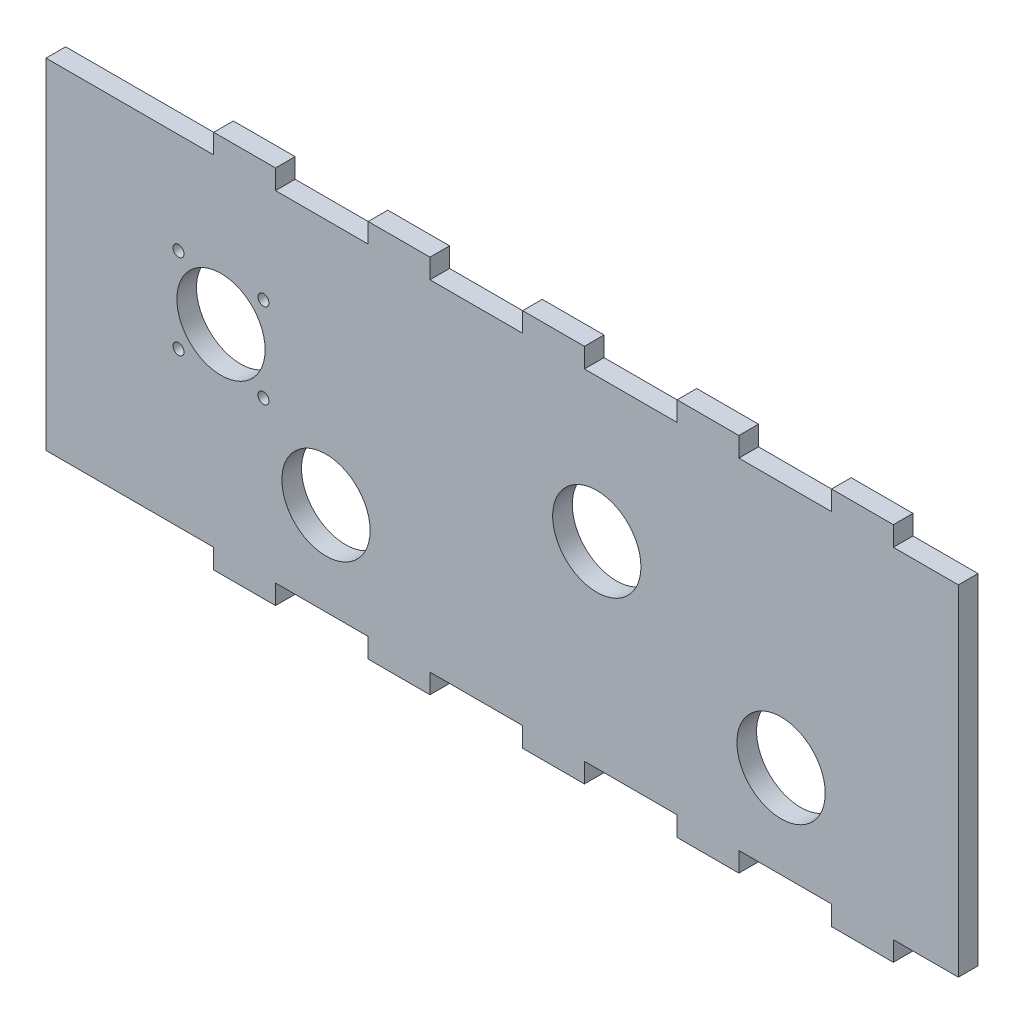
from build123d import *

# Parameters (mm, degrees)
SKETCH1_R           = 14.2875
SKETCH1_R_2         = 1.778
BOSS_EXTRUDE1_DEPTH = 6.35


with BuildPart() as part:
    # Sketch1 → Boss-Extrude1 (new body)
    with BuildSketch(Plane.XY):
        Polygon((0, 0), (54.3, 0), (54.3, -6.35), (74.3, -6.35), (74.3, 0), (104.3, 0), (104.3, -6.35), (124.3, -6.35), (124.3, 0), (154.3, 0), (154.3, -6.35), (174.3, -6.35), (174.3, 0), (204.3, 0), (204.3, -6.35), (224.3, -6.35), (224.3, 0), (254.3, 0), (254.3, -6.35), (274.3, -6.35), (274.3, 0), (295.36, 0), (295.36, 110), (274.3, 110), (274.3, 116.35), (254.3, 116.35), (254.3, 110), (224.3, 110), (224.3, 116.35), (204.3, 116.35), (204.3, 110), (174.3, 110), (174.3, 116.35), (154.3, 116.35), (154.3, 110), (124.3, 110), (124.3, 116.35), (104.3, 116.35), (104.3, 110), (74.3, 110), (74.3, 116.35), (54.3, 116.35), (54.3, 110), (0, 110), align=None)
        with Locations((90.64, 30)):
            Circle(SKETCH1_R, mode=Mode.SUBTRACT)
        with Locations((237.96, 30)):
            Circle(SKETCH1_R, mode=Mode.SUBTRACT)
        with Locations((178.306374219, 63.670386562)):
            Circle(SKETCH1_R, mode=Mode.SUBTRACT)
        with Locations((56.646374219, 63.670386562)):
            Circle(SKETCH1_R, mode=Mode.SUBTRACT)
        with Locations((42.897602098, 77.419158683)):
            Circle(SKETCH1_R_2, mode=Mode.SUBTRACT)
        with Locations((42.897602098, 49.921614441)):
            Circle(SKETCH1_R_2, mode=Mode.SUBTRACT)
        with Locations((70.395146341, 77.419158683)):
            Circle(SKETCH1_R_2, mode=Mode.SUBTRACT)
        with Locations((70.395146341, 49.921614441)):
            Circle(SKETCH1_R_2, mode=Mode.SUBTRACT)
    extrude(amount=BOSS_EXTRUDE1_DEPTH)


solid = part.part
